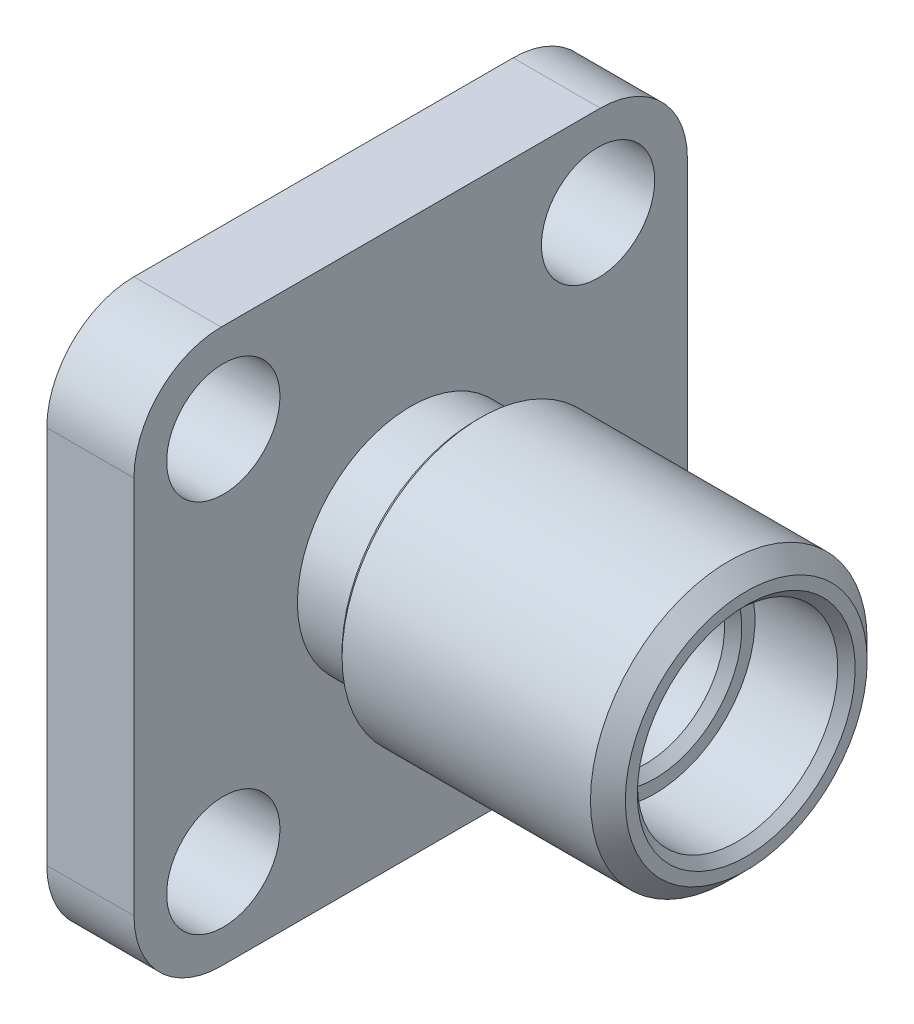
ISO-10303-21;
HEADER;
FILE_DESCRIPTION(('STEP AP214'),'2;1');
FILE_NAME('part.step','',(''),(''),'','','');
FILE_SCHEMA(('AUTOMOTIVE_DESIGN { 1 0 10303 214 1 1 1 1 }'));
ENDSEC;
DATA;
#1=APPLICATION_CONTEXT('core data for automotive mechanical design processes');
#2=APPLICATION_PROTOCOL_DEFINITION('international standard','automotive_design',2000,#1);
#3=PRODUCT_CONTEXT('',#1,'mechanical');
#4=PRODUCT('Part','Part','',(#3));
#5=PRODUCT_RELATED_PRODUCT_CATEGORY('part','',(#4));
#6=PRODUCT_DEFINITION_FORMATION('','',#4);
#7=PRODUCT_DEFINITION_CONTEXT('part definition',#1,'design');
#8=PRODUCT_DEFINITION('design','',#6,#7);
#9=PRODUCT_DEFINITION_SHAPE('','',#8);
#10=(LENGTH_UNIT() NAMED_UNIT(*) SI_UNIT(.MILLI.,.METRE.));
#11=(NAMED_UNIT(*) PLANE_ANGLE_UNIT() SI_UNIT($,.RADIAN.));
#12=(NAMED_UNIT(*) SI_UNIT($,.STERADIAN.) SOLID_ANGLE_UNIT());
#13=UNCERTAINTY_MEASURE_WITH_UNIT(LENGTH_MEASURE(1.E-05),#10,'distance_accuracy_value','');
#14=(GEOMETRIC_REPRESENTATION_CONTEXT(3) GLOBAL_UNCERTAINTY_ASSIGNED_CONTEXT((#13)) GLOBAL_UNIT_ASSIGNED_CONTEXT((#10,
#11,#12)) REPRESENTATION_CONTEXT('',''));
#15=CARTESIAN_POINT('',(0.,0.,0.));
#16=DIRECTION('',(0.,0.,1.));
#17=DIRECTION('',(1.,0.,0.));
#18=AXIS2_PLACEMENT_3D('',#15,#16,#17);
#19=CARTESIAN_POINT('',(2.,8.5,0.));
#20=DIRECTION('',(-1.,0.,0.));
#21=DIRECTION('',(0.,0.,1.));
#22=AXIS2_PLACEMENT_3D('',#19,#20,#21);
#23=PLANE('',#22);
#24=CARTESIAN_POINT('',(2.,4.3,4.3));
#25=DIRECTION('',(1.,0.,0.));
#26=DIRECTION('',(0.,0.,-1.));
#27=AXIS2_PLACEMENT_3D('',#24,#25,#26);
#28=CIRCLE('',#27,1.3);
#29=CARTESIAN_POINT('',(2.,4.3,3.));
#30=VERTEX_POINT('',#29);
#31=EDGE_CURVE('E334',#30,#30,#28,.T.);
#32=ORIENTED_EDGE('',*,*,#31,.F.);
#33=EDGE_LOOP('',(#32));
#34=FACE_BOUND('',#33,.T.);
#35=CARTESIAN_POINT('',(2.,4.3,-4.3));
#36=DIRECTION('',(1.,0.,0.));
#37=DIRECTION('',(0.,0.,-1.));
#38=AXIS2_PLACEMENT_3D('',#35,#36,#37);
#39=CIRCLE('',#38,1.3);
#40=CARTESIAN_POINT('',(2.,4.3,-5.6));
#41=VERTEX_POINT('',#40);
#42=EDGE_CURVE('E328',#41,#41,#39,.T.);
#43=ORIENTED_EDGE('',*,*,#42,.F.);
#44=EDGE_LOOP('',(#43));
#45=FACE_BOUND('',#44,.T.);
#46=CARTESIAN_POINT('',(2.,-4.3,-4.3));
#47=DIRECTION('',(1.,0.,0.));
#48=DIRECTION('',(0.,0.,-1.));
#49=AXIS2_PLACEMENT_3D('',#46,#47,#48);
#50=CIRCLE('',#49,1.3);
#51=CARTESIAN_POINT('',(2.,-4.3,-5.6));
#52=VERTEX_POINT('',#51);
#53=EDGE_CURVE('E322',#52,#52,#50,.T.);
#54=ORIENTED_EDGE('',*,*,#53,.F.);
#55=EDGE_LOOP('',(#54));
#56=FACE_BOUND('',#55,.T.);
#57=CARTESIAN_POINT('',(2.,-4.3,4.3));
#58=DIRECTION('',(1.,0.,0.));
#59=DIRECTION('',(0.,0.,-1.));
#60=AXIS2_PLACEMENT_3D('',#57,#58,#59);
#61=CIRCLE('',#60,1.3);
#62=CARTESIAN_POINT('',(2.,-4.3,3.));
#63=VERTEX_POINT('',#62);
#64=EDGE_CURVE('E316',#63,#63,#61,.T.);
#65=ORIENTED_EDGE('',*,*,#64,.F.);
#66=EDGE_LOOP('',(#65));
#67=FACE_BOUND('',#66,.T.);
#68=CARTESIAN_POINT('',(2.,0.,0.));
#69=DIRECTION('',(-1.,0.,0.));
#70=DIRECTION('',(0.,0.,1.));
#71=AXIS2_PLACEMENT_3D('',#68,#69,#70);
#72=CIRCLE('',#71,2.6);
#73=CARTESIAN_POINT('',(2.,0.,2.6));
#74=VERTEX_POINT('',#73);
#75=EDGE_CURVE('E179',#74,#74,#72,.T.);
#76=ORIENTED_EDGE('',*,*,#75,.T.);
#77=EDGE_LOOP('',(#76));
#78=FACE_BOUND('',#77,.T.);
#79=CARTESIAN_POINT('',(2.,4.35,4.35));
#80=DIRECTION('',(1.,0.,0.));
#81=DIRECTION('',(0.,0.,1.));
#82=AXIS2_PLACEMENT_3D('',#79,#80,#81);
#83=CIRCLE('',#82,2.);
#84=CARTESIAN_POINT('',(2.,6.35,4.34999999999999));
#85=VERTEX_POINT('',#84);
#86=CARTESIAN_POINT('',(2.,4.34999999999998,6.35));
#87=VERTEX_POINT('',#86);
#88=EDGE_CURVE('E138',#85,#87,#83,.T.);
#89=ORIENTED_EDGE('',*,*,#88,.T.);
#90=DIRECTION('',(0.,-1.,0.));
#91=VECTOR('',#90,1.);
#92=CARTESIAN_POINT('',(2.,-4.34999999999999,6.35));
#93=LINE('',#92,#91);
#94=CARTESIAN_POINT('',(2.,-4.34999999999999,6.35));
#95=VERTEX_POINT('',#94);
#96=EDGE_CURVE('E141',#87,#95,#93,.T.);
#97=ORIENTED_EDGE('',*,*,#96,.T.);
#98=CARTESIAN_POINT('',(2.,-4.35,4.35));
#99=DIRECTION('',(1.,0.,0.));
#100=DIRECTION('',(0.,0.,1.));
#101=AXIS2_PLACEMENT_3D('',#98,#99,#100);
#102=CIRCLE('',#101,2.);
#103=CARTESIAN_POINT('',(2.,-6.35,4.34999999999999));
#104=VERTEX_POINT('',#103);
#105=EDGE_CURVE('E51',#95,#104,#102,.T.);
#106=ORIENTED_EDGE('',*,*,#105,.T.);
#107=DIRECTION('',(0.,0.,-1.));
#108=VECTOR('',#107,1.);
#109=CARTESIAN_POINT('',(2.,-6.35,4.34999999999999));
#110=LINE('',#109,#108);
#111=CARTESIAN_POINT('',(2.,-6.35,-4.34999999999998));
#112=VERTEX_POINT('',#111);
#113=EDGE_CURVE('E108',#104,#112,#110,.T.);
#114=ORIENTED_EDGE('',*,*,#113,.T.);
#115=CARTESIAN_POINT('',(2.,-4.35,-4.35));
#116=DIRECTION('',(1.,0.,0.));
#117=DIRECTION('',(0.,0.,-1.));
#118=AXIS2_PLACEMENT_3D('',#115,#116,#117);
#119=CIRCLE('',#118,2.);
#120=CARTESIAN_POINT('',(2.,-4.34999999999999,-6.35));
#121=VERTEX_POINT('',#120);
#122=EDGE_CURVE('E147',#112,#121,#119,.T.);
#123=ORIENTED_EDGE('',*,*,#122,.T.);
#124=DIRECTION('',(0.,1.,0.));
#125=VECTOR('',#124,1.);
#126=CARTESIAN_POINT('',(2.,-4.34999999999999,-6.35));
#127=LINE('',#126,#125);
#128=CARTESIAN_POINT('',(2.,4.34999999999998,-6.35));
#129=VERTEX_POINT('',#128);
#130=EDGE_CURVE('E150',#121,#129,#127,.T.);
#131=ORIENTED_EDGE('',*,*,#130,.T.);
#132=CARTESIAN_POINT('',(2.,4.35,-4.35));
#133=DIRECTION('',(1.,0.,0.));
#134=DIRECTION('',(0.,0.,1.));
#135=AXIS2_PLACEMENT_3D('',#132,#133,#134);
#136=CIRCLE('',#135,2.);
#137=CARTESIAN_POINT('',(2.,6.35,-4.34999999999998));
#138=VERTEX_POINT('',#137);
#139=EDGE_CURVE('E153',#129,#138,#136,.T.);
#140=ORIENTED_EDGE('',*,*,#139,.T.);
#141=DIRECTION('',(0.,0.,1.));
#142=VECTOR('',#141,1.);
#143=CARTESIAN_POINT('',(2.,6.35,4.34999999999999));
#144=LINE('',#143,#142);
#145=EDGE_CURVE('E156',#138,#85,#144,.T.);
#146=ORIENTED_EDGE('',*,*,#145,.T.);
#147=EDGE_LOOP('',(#89,#97,#106,#114,#123,#131,#140,#146));
#148=FACE_BOUND('',#147,.T.);
#149=ADVANCED_FACE('F36',(#34,#45,#56,#67,#78,#148),#23,.F.);
#150=CARTESIAN_POINT('',(0.,2.,0.));
#151=DIRECTION('',(1.,0.,0.));
#152=DIRECTION('',(0.,0.,-1.));
#153=AXIS2_PLACEMENT_3D('',#150,#151,#152);
#154=PLANE('',#153);
#155=CARTESIAN_POINT('',(0.,4.3,4.3));
#156=DIRECTION('',(1.,0.,0.));
#157=DIRECTION('',(0.,0.,-1.));
#158=AXIS2_PLACEMENT_3D('',#155,#156,#157);
#159=CIRCLE('',#158,1.3);
#160=CARTESIAN_POINT('',(0.,4.3,3.));
#161=VERTEX_POINT('',#160);
#162=EDGE_CURVE('E331',#161,#161,#159,.T.);
#163=ORIENTED_EDGE('',*,*,#162,.T.);
#164=EDGE_LOOP('',(#163));
#165=FACE_BOUND('',#164,.T.);
#166=CARTESIAN_POINT('',(0.,4.3,-4.3));
#167=DIRECTION('',(1.,0.,0.));
#168=DIRECTION('',(0.,0.,-1.));
#169=AXIS2_PLACEMENT_3D('',#166,#167,#168);
#170=CIRCLE('',#169,1.3);
#171=CARTESIAN_POINT('',(0.,4.3,-5.6));
#172=VERTEX_POINT('',#171);
#173=EDGE_CURVE('E325',#172,#172,#170,.T.);
#174=ORIENTED_EDGE('',*,*,#173,.T.);
#175=EDGE_LOOP('',(#174));
#176=FACE_BOUND('',#175,.T.);
#177=CARTESIAN_POINT('',(0.,-4.3,-4.3));
#178=DIRECTION('',(1.,0.,0.));
#179=DIRECTION('',(0.,0.,-1.));
#180=AXIS2_PLACEMENT_3D('',#177,#178,#179);
#181=CIRCLE('',#180,1.3);
#182=CARTESIAN_POINT('',(0.,-4.3,-5.6));
#183=VERTEX_POINT('',#182);
#184=EDGE_CURVE('E319',#183,#183,#181,.T.);
#185=ORIENTED_EDGE('',*,*,#184,.T.);
#186=EDGE_LOOP('',(#185));
#187=FACE_BOUND('',#186,.T.);
#188=CARTESIAN_POINT('',(0.,-4.3,4.3));
#189=DIRECTION('',(1.,0.,0.));
#190=DIRECTION('',(0.,0.,-1.));
#191=AXIS2_PLACEMENT_3D('',#188,#189,#190);
#192=CIRCLE('',#191,1.3);
#193=CARTESIAN_POINT('',(0.,-4.3,3.));
#194=VERTEX_POINT('',#193);
#195=EDGE_CURVE('E142',#194,#194,#192,.T.);
#196=ORIENTED_EDGE('',*,*,#195,.T.);
#197=EDGE_LOOP('',(#196));
#198=FACE_BOUND('',#197,.T.);
#199=CARTESIAN_POINT('',(0.,0.,0.));
#200=DIRECTION('',(1.,0.,0.));
#201=DIRECTION('',(0.,0.,-1.));
#202=AXIS2_PLACEMENT_3D('',#199,#200,#201);
#203=CIRCLE('',#202,2.1);
#204=CARTESIAN_POINT('',(0.,0.,2.1));
#205=VERTEX_POINT('',#204);
#206=EDGE_CURVE('E209',#205,#205,#203,.T.);
#207=ORIENTED_EDGE('',*,*,#206,.T.);
#208=EDGE_LOOP('',(#207));
#209=FACE_BOUND('',#208,.T.);
#210=CARTESIAN_POINT('',(0.,4.35,4.35));
#211=DIRECTION('',(1.,0.,0.));
#212=DIRECTION('',(0.,0.,1.));
#213=AXIS2_PLACEMENT_3D('',#210,#211,#212);
#214=CIRCLE('',#213,2.);
#215=CARTESIAN_POINT('',(0.,6.35,4.34999999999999));
#216=VERTEX_POINT('',#215);
#217=CARTESIAN_POINT('',(0.,4.34999999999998,6.35));
#218=VERTEX_POINT('',#217);
#219=EDGE_CURVE('E59',#216,#218,#214,.T.);
#220=ORIENTED_EDGE('',*,*,#219,.F.);
#221=DIRECTION('',(0.,0.,1.));
#222=VECTOR('',#221,1.);
#223=CARTESIAN_POINT('',(0.,6.35,4.34999999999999));
#224=LINE('',#223,#222);
#225=CARTESIAN_POINT('',(0.,6.35,-4.34999999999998));
#226=VERTEX_POINT('',#225);
#227=EDGE_CURVE('E134',#226,#216,#224,.T.);
#228=ORIENTED_EDGE('',*,*,#227,.F.);
#229=CARTESIAN_POINT('',(0.,4.35,-4.35));
#230=DIRECTION('',(1.,0.,0.));
#231=DIRECTION('',(0.,0.,1.));
#232=AXIS2_PLACEMENT_3D('',#229,#230,#231);
#233=CIRCLE('',#232,2.);
#234=CARTESIAN_POINT('',(0.,4.34999999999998,-6.35));
#235=VERTEX_POINT('',#234);
#236=EDGE_CURVE('E131',#235,#226,#233,.T.);
#237=ORIENTED_EDGE('',*,*,#236,.F.);
#238=DIRECTION('',(0.,1.,0.));
#239=VECTOR('',#238,1.);
#240=CARTESIAN_POINT('',(0.,-4.34999999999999,-6.35));
#241=LINE('',#240,#239);
#242=CARTESIAN_POINT('',(0.,-4.34999999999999,-6.35));
#243=VERTEX_POINT('',#242);
#244=EDGE_CURVE('E125',#243,#235,#241,.T.);
#245=ORIENTED_EDGE('',*,*,#244,.F.);
#246=CARTESIAN_POINT('',(0.,-4.35,-4.35));
#247=DIRECTION('',(1.,0.,0.));
#248=DIRECTION('',(0.,0.,-1.));
#249=AXIS2_PLACEMENT_3D('',#246,#247,#248);
#250=CIRCLE('',#249,2.);
#251=CARTESIAN_POINT('',(0.,-6.35,-4.34999999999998));
#252=VERTEX_POINT('',#251);
#253=EDGE_CURVE('E123',#252,#243,#250,.T.);
#254=ORIENTED_EDGE('',*,*,#253,.F.);
#255=DIRECTION('',(0.,0.,-1.));
#256=VECTOR('',#255,1.);
#257=CARTESIAN_POINT('',(0.,-6.35,4.34999999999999));
#258=LINE('',#257,#256);
#259=CARTESIAN_POINT('',(0.,-6.35,4.34999999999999));
#260=VERTEX_POINT('',#259);
#261=EDGE_CURVE('E105',#260,#252,#258,.T.);
#262=ORIENTED_EDGE('',*,*,#261,.F.);
#263=CARTESIAN_POINT('',(0.,-4.35,4.35));
#264=DIRECTION('',(1.,0.,0.));
#265=DIRECTION('',(0.,0.,1.));
#266=AXIS2_PLACEMENT_3D('',#263,#264,#265);
#267=CIRCLE('',#266,2.);
#268=CARTESIAN_POINT('',(0.,-4.34999999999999,6.35));
#269=VERTEX_POINT('',#268);
#270=EDGE_CURVE('E113',#269,#260,#267,.T.);
#271=ORIENTED_EDGE('',*,*,#270,.F.);
#272=DIRECTION('',(0.,-1.,0.));
#273=VECTOR('',#272,1.);
#274=CARTESIAN_POINT('',(0.,-4.34999999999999,6.35));
#275=LINE('',#274,#273);
#276=EDGE_CURVE('E118',#218,#269,#275,.T.);
#277=ORIENTED_EDGE('',*,*,#276,.F.);
#278=EDGE_LOOP('',(#220,#228,#237,#245,#254,#262,#271,#277));
#279=FACE_BOUND('',#278,.T.);
#280=ADVANCED_FACE('F120',(#165,#176,#187,#198,#209,#279),#154,.F.);
#281=CARTESIAN_POINT('',(0.,0.,0.));
#282=DIRECTION('',(-1.,0.,0.));
#283=DIRECTION('',(0.,0.,1.));
#284=AXIS2_PLACEMENT_3D('',#281,#282,#283);
#285=CYLINDRICAL_SURFACE('',#284,2.6);
#286=ORIENTED_EDGE('',*,*,#75,.F.);
#287=EDGE_LOOP('',(#286));
#288=FACE_BOUND('',#287,.T.);
#289=CARTESIAN_POINT('',(3.5,0.,0.));
#290=DIRECTION('',(-1.,0.,0.));
#291=DIRECTION('',(0.,0.,1.));
#292=AXIS2_PLACEMENT_3D('',#289,#290,#291);
#293=CIRCLE('',#292,2.6);
#294=CARTESIAN_POINT('',(3.5,0.,2.6));
#295=VERTEX_POINT('',#294);
#296=EDGE_CURVE('E176',#295,#295,#293,.T.);
#297=ORIENTED_EDGE('',*,*,#296,.T.);
#298=EDGE_LOOP('',(#297));
#299=FACE_BOUND('',#298,.T.);
#300=ADVANCED_FACE('F237',(#288,#299),#285,.T.);
#301=CARTESIAN_POINT('',(3.5,2.6,0.));
#302=DIRECTION('',(1.,0.,0.));
#303=DIRECTION('',(0.,0.,-1.));
#304=AXIS2_PLACEMENT_3D('',#301,#302,#303);
#305=PLANE('',#304);
#306=CARTESIAN_POINT('',(3.5,0.,0.));
#307=DIRECTION('',(1.,0.,0.));
#308=DIRECTION('',(0.,0.,-1.));
#309=AXIS2_PLACEMENT_3D('',#306,#307,#308);
#310=CIRCLE('',#309,3.075);
#311=CARTESIAN_POINT('',(3.5,0.,-3.075));
#312=VERTEX_POINT('',#311);
#313=EDGE_CURVE('E44',#312,#312,#310,.F.);
#314=ORIENTED_EDGE('',*,*,#313,.T.);
#315=EDGE_LOOP('',(#314));
#316=FACE_BOUND('',#315,.T.);
#317=ORIENTED_EDGE('',*,*,#296,.F.);
#318=EDGE_LOOP('',(#317));
#319=FACE_BOUND('',#318,.T.);
#320=ADVANCED_FACE('F214',(#316,#319),#305,.F.);
#321=CARTESIAN_POINT('',(0.,0.,0.));
#322=DIRECTION('',(-1.,0.,0.));
#323=DIRECTION('',(0.,0.,1.));
#324=AXIS2_PLACEMENT_3D('',#321,#322,#323);
#325=CYLINDRICAL_SURFACE('',#324,3.175);
#326=CARTESIAN_POINT('',(3.6,0.,0.));
#327=DIRECTION('',(1.,0.,0.));
#328=DIRECTION('',(0.,0.,-1.));
#329=AXIS2_PLACEMENT_3D('',#326,#327,#328);
#330=CIRCLE('',#329,3.175);
#331=CARTESIAN_POINT('',(3.6,0.,-3.175));
#332=VERTEX_POINT('',#331);
#333=EDGE_CURVE('E11',#332,#332,#330,.T.);
#334=ORIENTED_EDGE('',*,*,#333,.T.);
#335=EDGE_LOOP('',(#334));
#336=FACE_BOUND('',#335,.T.);
#337=CARTESIAN_POINT('',(9.3,0.,0.));
#338=DIRECTION('',(-1.,0.,0.));
#339=DIRECTION('',(0.,0.,1.));
#340=AXIS2_PLACEMENT_3D('',#337,#338,#339);
#341=CIRCLE('',#340,3.175);
#342=CARTESIAN_POINT('',(9.3,0.,3.175));
#343=VERTEX_POINT('',#342);
#344=EDGE_CURVE('E182',#343,#343,#341,.T.);
#345=ORIENTED_EDGE('',*,*,#344,.T.);
#346=EDGE_LOOP('',(#345));
#347=FACE_BOUND('',#346,.T.);
#348=ADVANCED_FACE('F289',(#336,#347),#325,.T.);
#349=CARTESIAN_POINT('',(9.7,3.175,0.));
#350=DIRECTION('',(-1.,0.,0.));
#351=DIRECTION('',(0.,0.,1.));
#352=AXIS2_PLACEMENT_3D('',#349,#350,#351);
#353=PLANE('',#352);
#354=CARTESIAN_POINT('',(9.7,0.,0.));
#355=DIRECTION('',(-1.,0.,0.));
#356=DIRECTION('',(0.,0.,1.));
#357=AXIS2_PLACEMENT_3D('',#354,#355,#356);
#358=CIRCLE('',#357,2.5);
#359=CARTESIAN_POINT('',(9.7,0.,2.5));
#360=VERTEX_POINT('',#359);
#361=EDGE_CURVE('E188',#360,#360,#358,.T.);
#362=ORIENTED_EDGE('',*,*,#361,.T.);
#363=EDGE_LOOP('',(#362));
#364=FACE_BOUND('',#363,.T.);
#365=CARTESIAN_POINT('',(9.7,0.,0.));
#366=DIRECTION('',(-1.,0.,0.));
#367=DIRECTION('',(0.,0.,1.));
#368=AXIS2_PLACEMENT_3D('',#365,#366,#367);
#369=CIRCLE('',#368,2.775);
#370=CARTESIAN_POINT('',(9.7,0.,2.775));
#371=VERTEX_POINT('',#370);
#372=EDGE_CURVE('E185',#371,#371,#369,.F.);
#373=ORIENTED_EDGE('',*,*,#372,.T.);
#374=EDGE_LOOP('',(#373));
#375=FACE_BOUND('',#374,.T.);
#376=ADVANCED_FACE('F283',(#364,#375),#353,.F.);
#377=CARTESIAN_POINT('',(0.,0.,0.));
#378=DIRECTION('',(-1.,0.,0.));
#379=DIRECTION('',(0.,0.,1.));
#380=AXIS2_PLACEMENT_3D('',#377,#378,#379);
#381=CYLINDRICAL_SURFACE('',#380,2.3);
#382=CARTESIAN_POINT('',(9.5,0.,0.));
#383=DIRECTION('',(-1.,0.,0.));
#384=DIRECTION('',(0.,0.,1.));
#385=AXIS2_PLACEMENT_3D('',#382,#383,#384);
#386=CIRCLE('',#385,2.3);
#387=CARTESIAN_POINT('',(9.5,0.,2.3));
#388=VERTEX_POINT('',#387);
#389=EDGE_CURVE('E191',#388,#388,#386,.F.);
#390=ORIENTED_EDGE('',*,*,#389,.T.);
#391=EDGE_LOOP('',(#390));
#392=FACE_BOUND('',#391,.T.);
#393=CARTESIAN_POINT('',(7.6,0.,0.));
#394=DIRECTION('',(-1.,0.,0.));
#395=DIRECTION('',(0.,0.,1.));
#396=AXIS2_PLACEMENT_3D('',#393,#394,#395);
#397=CIRCLE('',#396,2.3);
#398=CARTESIAN_POINT('',(7.6,0.,2.3));
#399=VERTEX_POINT('',#398);
#400=EDGE_CURVE('E173',#399,#399,#397,.T.);
#401=ORIENTED_EDGE('',*,*,#400,.T.);
#402=EDGE_LOOP('',(#401));
#403=FACE_BOUND('',#402,.T.);
#404=ADVANCED_FACE('F278',(#392,#403),#381,.F.);
#405=CARTESIAN_POINT('',(7.6,2.3,0.));
#406=DIRECTION('',(-1.,0.,0.));
#407=DIRECTION('',(0.,0.,1.));
#408=AXIS2_PLACEMENT_3D('',#405,#406,#407);
#409=PLANE('',#408);
#410=CARTESIAN_POINT('',(7.6,0.,0.));
#411=DIRECTION('',(-1.,0.,0.));
#412=DIRECTION('',(0.,0.,1.));
#413=AXIS2_PLACEMENT_3D('',#410,#411,#412);
#414=CIRCLE('',#413,2.);
#415=CARTESIAN_POINT('',(7.6,0.,2.));
#416=VERTEX_POINT('',#415);
#417=EDGE_CURVE('E194',#416,#416,#414,.T.);
#418=ORIENTED_EDGE('',*,*,#417,.T.);
#419=EDGE_LOOP('',(#418));
#420=FACE_BOUND('',#419,.T.);
#421=ORIENTED_EDGE('',*,*,#400,.F.);
#422=EDGE_LOOP('',(#421));
#423=FACE_BOUND('',#422,.T.);
#424=ADVANCED_FACE('F270',(#420,#423),#409,.F.);
#425=CARTESIAN_POINT('',(0.,0.,0.));
#426=DIRECTION('',(-1.,0.,0.));
#427=DIRECTION('',(0.,0.,1.));
#428=AXIS2_PLACEMENT_3D('',#425,#426,#427);
#429=CYLINDRICAL_SURFACE('',#428,1.8);
#430=CARTESIAN_POINT('',(6.6,0.,0.));
#431=DIRECTION('',(1.,0.,0.));
#432=DIRECTION('',(0.,0.,-1.));
#433=AXIS2_PLACEMENT_3D('',#430,#431,#432);
#434=CIRCLE('',#433,1.8);
#435=CARTESIAN_POINT('',(6.6,0.,-1.8));
#436=VERTEX_POINT('',#435);
#437=EDGE_CURVE('E200',#436,#436,#434,.F.);
#438=ORIENTED_EDGE('',*,*,#437,.T.);
#439=EDGE_LOOP('',(#438));
#440=FACE_BOUND('',#439,.T.);
#441=CARTESIAN_POINT('',(7.4,0.,0.));
#442=DIRECTION('',(-1.,0.,0.));
#443=DIRECTION('',(0.,0.,1.));
#444=AXIS2_PLACEMENT_3D('',#441,#442,#443);
#445=CIRCLE('',#444,1.8);
#446=CARTESIAN_POINT('',(7.4,0.,1.8));
#447=VERTEX_POINT('',#446);
#448=EDGE_CURVE('E197',#447,#447,#445,.F.);
#449=ORIENTED_EDGE('',*,*,#448,.T.);
#450=EDGE_LOOP('',(#449));
#451=FACE_BOUND('',#450,.T.);
#452=ADVANCED_FACE('F266',(#440,#451),#429,.F.);
#453=CARTESIAN_POINT('',(6.5,2.,0.));
#454=DIRECTION('',(1.,0.,0.));
#455=DIRECTION('',(0.,0.,-1.));
#456=AXIS2_PLACEMENT_3D('',#453,#454,#455);
#457=PLANE('',#456);
#458=CARTESIAN_POINT('',(6.5,0.,0.));
#459=DIRECTION('',(1.,0.,0.));
#460=DIRECTION('',(0.,0.,-1.));
#461=AXIS2_PLACEMENT_3D('',#458,#459,#460);
#462=CIRCLE('',#461,1.9);
#463=CARTESIAN_POINT('',(6.5,0.,-1.9));
#464=VERTEX_POINT('',#463);
#465=EDGE_CURVE('E203',#464,#464,#462,.T.);
#466=ORIENTED_EDGE('',*,*,#465,.T.);
#467=EDGE_LOOP('',(#466));
#468=FACE_BOUND('',#467,.T.);
#469=CARTESIAN_POINT('',(6.5,0.,0.));
#470=DIRECTION('',(-1.,0.,0.));
#471=DIRECTION('',(0.,0.,1.));
#472=AXIS2_PLACEMENT_3D('',#469,#470,#471);
#473=CIRCLE('',#472,2.);
#474=CARTESIAN_POINT('',(6.5,0.,2.));
#475=VERTEX_POINT('',#474);
#476=EDGE_CURVE('E161',#475,#475,#473,.T.);
#477=ORIENTED_EDGE('',*,*,#476,.T.);
#478=EDGE_LOOP('',(#477));
#479=FACE_BOUND('',#478,.T.);
#480=ADVANCED_FACE('F269',(#468,#479),#457,.F.);
#481=CARTESIAN_POINT('',(0.,0.,0.));
#482=DIRECTION('',(-1.,0.,0.));
#483=DIRECTION('',(0.,0.,1.));
#484=AXIS2_PLACEMENT_3D('',#481,#482,#483);
#485=CYLINDRICAL_SURFACE('',#484,2.);
#486=CARTESIAN_POINT('',(0.0999999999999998,0.,0.));
#487=DIRECTION('',(1.,0.,0.));
#488=DIRECTION('',(0.,0.,-1.));
#489=AXIS2_PLACEMENT_3D('',#486,#487,#488);
#490=CIRCLE('',#489,2.);
#491=CARTESIAN_POINT('',(0.0999999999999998,0.,2.));
#492=VERTEX_POINT('',#491);
#493=EDGE_CURVE('E206',#492,#492,#490,.F.);
#494=ORIENTED_EDGE('',*,*,#493,.T.);
#495=EDGE_LOOP('',(#494));
#496=FACE_BOUND('',#495,.T.);
#497=ORIENTED_EDGE('',*,*,#476,.F.);
#498=EDGE_LOOP('',(#497));
#499=FACE_BOUND('',#498,.T.);
#500=ADVANCED_FACE('F375',(#496,#499),#485,.F.);
#501=CARTESIAN_POINT('',(0.,4.35,4.35));
#502=DIRECTION('',(1.,0.,0.));
#503=DIRECTION('',(0.,0.,-1.));
#504=AXIS2_PLACEMENT_3D('',#501,#502,#503);
#505=CYLINDRICAL_SURFACE('',#504,2.);
#506=ORIENTED_EDGE('',*,*,#88,.F.);
#507=DIRECTION('',(1.,0.,0.));
#508=VECTOR('',#507,1.);
#509=CARTESIAN_POINT('',(0.,6.35,4.34999999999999));
#510=LINE('',#509,#508);
#511=EDGE_CURVE('E159',#216,#85,#510,.T.);
#512=ORIENTED_EDGE('',*,*,#511,.F.);
#513=ORIENTED_EDGE('',*,*,#219,.T.);
#514=DIRECTION('',(1.,0.,0.));
#515=VECTOR('',#514,1.);
#516=CARTESIAN_POINT('',(0.,4.34999999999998,6.35));
#517=LINE('',#516,#515);
#518=EDGE_CURVE('E137',#218,#87,#517,.T.);
#519=ORIENTED_EDGE('',*,*,#518,.T.);
#520=EDGE_LOOP('',(#506,#512,#513,#519));
#521=FACE_BOUND('',#520,.T.);
#522=ADVANCED_FACE('F310',(#521),#505,.T.);
#523=CARTESIAN_POINT('',(0.,6.35,4.34999999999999));
#524=DIRECTION('',(0.,1.,0.));
#525=DIRECTION('',(0.,0.,1.));
#526=AXIS2_PLACEMENT_3D('',#523,#524,#525);
#527=PLANE('',#526);
#528=ORIENTED_EDGE('',*,*,#145,.F.);
#529=DIRECTION('',(1.,0.,0.));
#530=VECTOR('',#529,1.);
#531=CARTESIAN_POINT('',(0.,6.35,-4.34999999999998));
#532=LINE('',#531,#530);
#533=EDGE_CURVE('E162',#226,#138,#532,.T.);
#534=ORIENTED_EDGE('',*,*,#533,.F.);
#535=ORIENTED_EDGE('',*,*,#227,.T.);
#536=ORIENTED_EDGE('',*,*,#511,.T.);
#537=EDGE_LOOP('',(#528,#534,#535,#536));
#538=FACE_BOUND('',#537,.T.);
#539=ADVANCED_FACE('F352',(#538),#527,.T.);
#540=CARTESIAN_POINT('',(0.,4.35,-4.35));
#541=DIRECTION('',(1.,0.,0.));
#542=DIRECTION('',(0.,0.,-1.));
#543=AXIS2_PLACEMENT_3D('',#540,#541,#542);
#544=CYLINDRICAL_SURFACE('',#543,2.);
#545=ORIENTED_EDGE('',*,*,#139,.F.);
#546=DIRECTION('',(1.,0.,0.));
#547=VECTOR('',#546,1.);
#548=CARTESIAN_POINT('',(0.,4.34999999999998,-6.35));
#549=LINE('',#548,#547);
#550=EDGE_CURVE('E164',#235,#129,#549,.T.);
#551=ORIENTED_EDGE('',*,*,#550,.F.);
#552=ORIENTED_EDGE('',*,*,#236,.T.);
#553=ORIENTED_EDGE('',*,*,#533,.T.);
#554=EDGE_LOOP('',(#545,#551,#552,#553));
#555=FACE_BOUND('',#554,.T.);
#556=ADVANCED_FACE('F355',(#555),#544,.T.);
#557=CARTESIAN_POINT('',(0.,-4.34999999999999,-6.35));
#558=DIRECTION('',(0.,0.,-1.));
#559=DIRECTION('',(-1.,0.,0.));
#560=AXIS2_PLACEMENT_3D('',#557,#558,#559);
#561=PLANE('',#560);
#562=ORIENTED_EDGE('',*,*,#130,.F.);
#563=DIRECTION('',(1.,0.,0.));
#564=VECTOR('',#563,1.);
#565=CARTESIAN_POINT('',(0.,-4.34999999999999,-6.35));
#566=LINE('',#565,#564);
#567=EDGE_CURVE('E166',#243,#121,#566,.T.);
#568=ORIENTED_EDGE('',*,*,#567,.F.);
#569=ORIENTED_EDGE('',*,*,#244,.T.);
#570=ORIENTED_EDGE('',*,*,#550,.T.);
#571=EDGE_LOOP('',(#562,#568,#569,#570));
#572=FACE_BOUND('',#571,.T.);
#573=ADVANCED_FACE('F359',(#572),#561,.T.);
#574=CARTESIAN_POINT('',(0.,-4.35,-4.35));
#575=DIRECTION('',(1.,0.,0.));
#576=DIRECTION('',(0.,0.,-1.));
#577=AXIS2_PLACEMENT_3D('',#574,#575,#576);
#578=CYLINDRICAL_SURFACE('',#577,2.);
#579=ORIENTED_EDGE('',*,*,#122,.F.);
#580=DIRECTION('',(1.,0.,0.));
#581=VECTOR('',#580,1.);
#582=CARTESIAN_POINT('',(0.,-6.35,-4.34999999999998));
#583=LINE('',#582,#581);
#584=EDGE_CURVE('E109',#252,#112,#583,.T.);
#585=ORIENTED_EDGE('',*,*,#584,.F.);
#586=ORIENTED_EDGE('',*,*,#253,.T.);
#587=ORIENTED_EDGE('',*,*,#567,.T.);
#588=EDGE_LOOP('',(#579,#585,#586,#587));
#589=FACE_BOUND('',#588,.T.);
#590=ADVANCED_FACE('F363',(#589),#578,.T.);
#591=CARTESIAN_POINT('',(0.,-6.35,4.34999999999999));
#592=DIRECTION('',(0.,-1.,0.));
#593=DIRECTION('',(0.,0.,-1.));
#594=AXIS2_PLACEMENT_3D('',#591,#592,#593);
#595=PLANE('',#594);
#596=ORIENTED_EDGE('',*,*,#113,.F.);
#597=DIRECTION('',(1.,0.,0.));
#598=VECTOR('',#597,1.);
#599=CARTESIAN_POINT('',(0.,-6.35,4.34999999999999));
#600=LINE('',#599,#598);
#601=EDGE_CURVE('E101',#260,#104,#600,.T.);
#602=ORIENTED_EDGE('',*,*,#601,.F.);
#603=ORIENTED_EDGE('',*,*,#261,.T.);
#604=ORIENTED_EDGE('',*,*,#584,.T.);
#605=EDGE_LOOP('',(#596,#602,#603,#604));
#606=FACE_BOUND('',#605,.T.);
#607=ADVANCED_FACE('F103',(#606),#595,.T.);
#608=CARTESIAN_POINT('',(0.,-4.35,4.35));
#609=DIRECTION('',(1.,0.,0.));
#610=DIRECTION('',(0.,0.,-1.));
#611=AXIS2_PLACEMENT_3D('',#608,#609,#610);
#612=CYLINDRICAL_SURFACE('',#611,2.);
#613=ORIENTED_EDGE('',*,*,#105,.F.);
#614=DIRECTION('',(1.,0.,0.));
#615=VECTOR('',#614,1.);
#616=CARTESIAN_POINT('',(0.,-4.34999999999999,6.35));
#617=LINE('',#616,#615);
#618=EDGE_CURVE('E110',#269,#95,#617,.T.);
#619=ORIENTED_EDGE('',*,*,#618,.F.);
#620=ORIENTED_EDGE('',*,*,#270,.T.);
#621=ORIENTED_EDGE('',*,*,#601,.T.);
#622=EDGE_LOOP('',(#613,#619,#620,#621));
#623=FACE_BOUND('',#622,.T.);
#624=ADVANCED_FACE('F114',(#623),#612,.T.);
#625=CARTESIAN_POINT('',(0.,-4.34999999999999,6.35));
#626=DIRECTION('',(0.,0.,1.));
#627=DIRECTION('',(1.,0.,0.));
#628=AXIS2_PLACEMENT_3D('',#625,#626,#627);
#629=PLANE('',#628);
#630=ORIENTED_EDGE('',*,*,#96,.F.);
#631=ORIENTED_EDGE('',*,*,#518,.F.);
#632=ORIENTED_EDGE('',*,*,#276,.T.);
#633=ORIENTED_EDGE('',*,*,#618,.T.);
#634=EDGE_LOOP('',(#630,#631,#632,#633));
#635=FACE_BOUND('',#634,.T.);
#636=ADVANCED_FACE('F249',(#635),#629,.T.);
#637=CARTESIAN_POINT('',(9.3,0.,0.));
#638=DIRECTION('',(-1.,0.,0.));
#639=DIRECTION('',(0.,0.,1.));
#640=AXIS2_PLACEMENT_3D('',#637,#638,#639);
#641=CONICAL_SURFACE('',#640,3.175,0.785398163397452);
#642=CARTESIAN_POINT('',(9.7,0.,2.775));
#643=CARTESIAN_POINT('',(9.69583333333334,0.,2.77916666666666));
#644=CARTESIAN_POINT('',(9.69166666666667,0.,2.78333333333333));
#645=CARTESIAN_POINT('',(9.68333333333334,0.,2.79166666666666));
#646=CARTESIAN_POINT('',(9.67916666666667,0.,2.79583333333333));
#647=CARTESIAN_POINT('',(9.67083333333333,0.,2.80416666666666));
#648=CARTESIAN_POINT('',(9.66666666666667,0.,2.80833333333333));
#649=CARTESIAN_POINT('',(9.65833333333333,0.,2.81666666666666));
#650=CARTESIAN_POINT('',(9.65416666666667,0.,2.82083333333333));
#651=CARTESIAN_POINT('',(9.64583333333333,0.,2.82916666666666));
#652=CARTESIAN_POINT('',(9.64166666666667,0.,2.83333333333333));
#653=CARTESIAN_POINT('',(9.63333333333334,0.,2.84166666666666));
#654=CARTESIAN_POINT('',(9.62916666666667,0.,2.84583333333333));
#655=CARTESIAN_POINT('',(9.62083333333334,0.,2.85416666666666));
#656=CARTESIAN_POINT('',(9.61666666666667,0.,2.85833333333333));
#657=CARTESIAN_POINT('',(9.60833333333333,0.,2.86666666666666));
#658=CARTESIAN_POINT('',(9.60416666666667,0.,2.87083333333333));
#659=CARTESIAN_POINT('',(9.59583333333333,0.,2.87916666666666));
#660=CARTESIAN_POINT('',(9.59166666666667,0.,2.88333333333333));
#661=CARTESIAN_POINT('',(9.58333333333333,0.,2.89166666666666));
#662=CARTESIAN_POINT('',(9.57916666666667,0.,2.89583333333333));
#663=CARTESIAN_POINT('',(9.57083333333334,0.,2.90416666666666));
#664=CARTESIAN_POINT('',(9.56666666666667,0.,2.90833333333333));
#665=CARTESIAN_POINT('',(9.55833333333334,0.,2.91666666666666));
#666=CARTESIAN_POINT('',(9.55416666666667,0.,2.92083333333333));
#667=CARTESIAN_POINT('',(9.54583333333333,0.,2.92916666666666));
#668=CARTESIAN_POINT('',(9.54166666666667,0.,2.93333333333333));
#669=CARTESIAN_POINT('',(9.53333333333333,0.,2.94166666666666));
#670=CARTESIAN_POINT('',(9.52916666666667,0.,2.94583333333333));
#671=CARTESIAN_POINT('',(9.52083333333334,0.,2.95416666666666));
#672=CARTESIAN_POINT('',(9.51666666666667,0.,2.95833333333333));
#673=CARTESIAN_POINT('',(9.50833333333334,0.,2.96666666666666));
#674=CARTESIAN_POINT('',(9.50416666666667,0.,2.97083333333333));
#675=CARTESIAN_POINT('',(9.49583333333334,0.,2.97916666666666));
#676=CARTESIAN_POINT('',(9.49166666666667,0.,2.98333333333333));
#677=CARTESIAN_POINT('',(9.48333333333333,0.,2.99166666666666));
#678=CARTESIAN_POINT('',(9.47916666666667,0.,2.99583333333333));
#679=CARTESIAN_POINT('',(9.47083333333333,0.,3.00416666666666));
#680=CARTESIAN_POINT('',(9.46666666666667,0.,3.00833333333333));
#681=CARTESIAN_POINT('',(9.45833333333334,0.,3.01666666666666));
#682=CARTESIAN_POINT('',(9.45416666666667,0.,3.02083333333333));
#683=CARTESIAN_POINT('',(9.44583333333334,0.,3.02916666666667));
#684=CARTESIAN_POINT('',(9.44166666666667,0.,3.03333333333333));
#685=CARTESIAN_POINT('',(9.43333333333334,0.,3.04166666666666));
#686=CARTESIAN_POINT('',(9.42916666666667,0.,3.04583333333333));
#687=CARTESIAN_POINT('',(9.42083333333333,0.,3.05416666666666));
#688=CARTESIAN_POINT('',(9.41666666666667,0.,3.05833333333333));
#689=CARTESIAN_POINT('',(9.40833333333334,0.,3.06666666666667));
#690=CARTESIAN_POINT('',(9.40416666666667,0.,3.07083333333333));
#691=CARTESIAN_POINT('',(9.39583333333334,0.,3.07916666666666));
#692=CARTESIAN_POINT('',(9.39166666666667,0.,3.08333333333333));
#693=CARTESIAN_POINT('',(9.38333333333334,0.,3.09166666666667));
#694=CARTESIAN_POINT('',(9.37916666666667,0.,3.09583333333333));
#695=CARTESIAN_POINT('',(9.37083333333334,0.,3.10416666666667));
#696=CARTESIAN_POINT('',(9.36666666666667,0.,3.10833333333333));
#697=CARTESIAN_POINT('',(9.35833333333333,0.,3.11666666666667));
#698=CARTESIAN_POINT('',(9.35416666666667,0.,3.12083333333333));
#699=CARTESIAN_POINT('',(9.34583333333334,0.,3.12916666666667));
#700=CARTESIAN_POINT('',(9.34166666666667,0.,3.13333333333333));
#701=CARTESIAN_POINT('',(9.33333333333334,0.,3.14166666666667));
#702=CARTESIAN_POINT('',(9.32916666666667,0.,3.14583333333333));
#703=CARTESIAN_POINT('',(9.32083333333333,0.,3.15416666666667));
#704=CARTESIAN_POINT('',(9.31666666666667,0.,3.15833333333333));
#705=CARTESIAN_POINT('',(9.30833333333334,0.,3.16666666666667));
#706=CARTESIAN_POINT('',(9.30416666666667,0.,3.17083333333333));
#707=CARTESIAN_POINT('',(9.3,0.,3.175));
#708=B_SPLINE_CURVE_WITH_KNOTS('',3,(#642,#643,#644,#645,#646,#647,#648,#649,#650,#651,#652,
#653,#654,#655,#656,#657,#658,#659,#660,#661,#662,#663,#664,#665,#666,#667,#668,#669,#670,#671,
#672,#673,#674,#675,#676,#677,#678,#679,#680,#681,#682,#683,#684,#685,#686,#687,#688,#689,#690,
#691,#692,#693,#694,#695,#696,#697,#698,#699,#700,#701,#702,#703,#704,#705,#706,#707),
.UNSPECIFIED.,.F.,.F.,(4,2,2,2,2,2,2,2,2,2,2,2,2,2,2,2,2,2,2,2,2,2,2,2,2,2,2,2,2,2,2,2,4),(0.,
0.0176776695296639,0.0353553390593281,0.053033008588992,0.0707106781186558,0.0883883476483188,
0.106066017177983,0.123743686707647,0.141421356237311,0.159099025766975,0.176776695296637,
0.194454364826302,0.212132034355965,0.229809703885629,0.247487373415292,0.265165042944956,
0.28284271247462,0.300520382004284,0.318198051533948,0.335875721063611,0.353553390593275,
0.371231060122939,0.388908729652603,0.406586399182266,0.42426406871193,0.441941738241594,
0.459619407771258,0.477297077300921,0.494974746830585,0.512652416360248,0.530330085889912,
0.548007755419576,0.56568542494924),.UNSPECIFIED.);
#709=EDGE_CURVE('BSEAM245',#371,#343,#708,.T.);
#710=ORIENTED_EDGE('',*,*,#372,.F.);
#711=ORIENTED_EDGE('',*,*,#344,.F.);
#712=ORIENTED_EDGE('',*,*,#709,.T.);
#713=ORIENTED_EDGE('',*,*,#709,.F.);
#714=EDGE_LOOP('',(#710,#712,#711,#713));
#715=FACE_BOUND('',#714,.T.);
#716=ADVANCED_FACE('F245',(#715),#641,.T.);
#717=CARTESIAN_POINT('',(9.7,0.,0.));
#718=DIRECTION('',(1.,0.,0.));
#719=DIRECTION('',(0.,0.,-1.));
#720=AXIS2_PLACEMENT_3D('',#717,#718,#719);
#721=CONICAL_SURFACE('',#720,2.5,0.78539816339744);
#722=ORIENTED_EDGE('',*,*,#389,.F.);
#723=EDGE_LOOP('',(#722));
#724=FACE_BOUND('',#723,.T.);
#725=ORIENTED_EDGE('',*,*,#361,.F.);
#726=EDGE_LOOP('',(#725));
#727=FACE_BOUND('',#726,.T.);
#728=ADVANCED_FACE('F248',(#724,#727),#721,.F.);
#729=CARTESIAN_POINT('',(7.6,0.,0.));
#730=DIRECTION('',(1.,0.,0.));
#731=DIRECTION('',(0.,0.,-1.));
#732=AXIS2_PLACEMENT_3D('',#729,#730,#731);
#733=CONICAL_SURFACE('',#732,2.,0.785398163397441);
#734=ORIENTED_EDGE('',*,*,#448,.F.);
#735=EDGE_LOOP('',(#734));
#736=FACE_BOUND('',#735,.T.);
#737=ORIENTED_EDGE('',*,*,#417,.F.);
#738=EDGE_LOOP('',(#737));
#739=FACE_BOUND('',#738,.T.);
#740=ADVANCED_FACE('F253',(#736,#739),#733,.F.);
#741=CARTESIAN_POINT('',(6.6,0.,0.));
#742=DIRECTION('',(-1.,0.,0.));
#743=DIRECTION('',(0.,0.,1.));
#744=AXIS2_PLACEMENT_3D('',#741,#742,#743);
#745=CONICAL_SURFACE('',#744,1.8,0.785398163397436);
#746=ORIENTED_EDGE('',*,*,#465,.F.);
#747=EDGE_LOOP('',(#746));
#748=FACE_BOUND('',#747,.T.);
#749=ORIENTED_EDGE('',*,*,#437,.F.);
#750=EDGE_LOOP('',(#749));
#751=FACE_BOUND('',#750,.T.);
#752=ADVANCED_FACE('F228',(#748,#751),#745,.F.);
#753=CARTESIAN_POINT('',(0.0999999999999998,0.,0.));
#754=DIRECTION('',(-1.,0.,0.));
#755=DIRECTION('',(0.,0.,1.));
#756=AXIS2_PLACEMENT_3D('',#753,#754,#755);
#757=CONICAL_SURFACE('',#756,2.,0.785398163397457);
#758=CARTESIAN_POINT('',(0.,0.,2.1));
#759=CARTESIAN_POINT('',(0.00104166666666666,0.,2.09895833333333));
#760=CARTESIAN_POINT('',(0.00208333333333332,0.,2.09791666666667));
#761=CARTESIAN_POINT('',(0.00416666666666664,0.,2.09583333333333));
#762=CARTESIAN_POINT('',(0.00520833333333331,0.,2.09479166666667));
#763=CARTESIAN_POINT('',(0.00729166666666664,0.,2.09270833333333));
#764=CARTESIAN_POINT('',(0.00833333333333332,0.,2.09166666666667));
#765=CARTESIAN_POINT('',(0.0104166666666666,0.,2.08958333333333));
#766=CARTESIAN_POINT('',(0.0114583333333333,0.,2.08854166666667));
#767=CARTESIAN_POINT('',(0.0135416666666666,0.,2.08645833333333));
#768=CARTESIAN_POINT('',(0.0145833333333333,0.,2.08541666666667));
#769=CARTESIAN_POINT('',(0.0166666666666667,0.,2.08333333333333));
#770=CARTESIAN_POINT('',(0.0177083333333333,0.,2.08229166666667));
#771=CARTESIAN_POINT('',(0.0197916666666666,0.,2.08020833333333));
#772=CARTESIAN_POINT('',(0.0208333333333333,0.,2.07916666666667));
#773=CARTESIAN_POINT('',(0.0229166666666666,0.,2.07708333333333));
#774=CARTESIAN_POINT('',(0.0239583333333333,0.,2.07604166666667));
#775=CARTESIAN_POINT('',(0.0260416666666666,0.,2.07395833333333));
#776=CARTESIAN_POINT('',(0.0270833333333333,0.,2.07291666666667));
#777=CARTESIAN_POINT('',(0.0291666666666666,0.,2.07083333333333));
#778=CARTESIAN_POINT('',(0.0302083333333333,0.,2.06979166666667));
#779=CARTESIAN_POINT('',(0.0322916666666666,0.,2.06770833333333));
#780=CARTESIAN_POINT('',(0.0333333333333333,0.,2.06666666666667));
#781=CARTESIAN_POINT('',(0.0354166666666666,0.,2.06458333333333));
#782=CARTESIAN_POINT('',(0.0364583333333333,0.,2.06354166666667));
#783=CARTESIAN_POINT('',(0.0385416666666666,0.,2.06145833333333));
#784=CARTESIAN_POINT('',(0.0395833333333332,0.,2.06041666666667));
#785=CARTESIAN_POINT('',(0.0416666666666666,0.,2.05833333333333));
#786=CARTESIAN_POINT('',(0.0427083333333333,0.,2.05729166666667));
#787=CARTESIAN_POINT('',(0.0447916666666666,0.,2.05520833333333));
#788=CARTESIAN_POINT('',(0.0458333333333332,0.,2.05416666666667));
#789=CARTESIAN_POINT('',(0.0479166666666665,0.,2.05208333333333));
#790=CARTESIAN_POINT('',(0.0489583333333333,0.,2.05104166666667));
#791=CARTESIAN_POINT('',(0.0510416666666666,0.,2.04895833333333));
#792=CARTESIAN_POINT('',(0.0520833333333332,0.,2.04791666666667));
#793=CARTESIAN_POINT('',(0.0541666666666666,0.,2.04583333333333));
#794=CARTESIAN_POINT('',(0.0552083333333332,0.,2.04479166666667));
#795=CARTESIAN_POINT('',(0.0572916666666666,0.,2.04270833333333));
#796=CARTESIAN_POINT('',(0.0583333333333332,0.,2.04166666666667));
#797=CARTESIAN_POINT('',(0.0604166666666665,0.,2.03958333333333));
#798=CARTESIAN_POINT('',(0.0614583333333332,0.,2.03854166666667));
#799=CARTESIAN_POINT('',(0.0635416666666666,0.,2.03645833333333));
#800=CARTESIAN_POINT('',(0.0645833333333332,0.,2.03541666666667));
#801=CARTESIAN_POINT('',(0.0666666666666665,0.,2.03333333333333));
#802=CARTESIAN_POINT('',(0.0677083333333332,0.,2.03229166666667));
#803=CARTESIAN_POINT('',(0.0697916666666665,0.,2.03020833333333));
#804=CARTESIAN_POINT('',(0.0708333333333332,0.,2.02916666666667));
#805=CARTESIAN_POINT('',(0.0729166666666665,0.,2.02708333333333));
#806=CARTESIAN_POINT('',(0.0739583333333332,0.,2.02604166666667));
#807=CARTESIAN_POINT('',(0.0760416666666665,0.,2.02395833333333));
#808=CARTESIAN_POINT('',(0.0770833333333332,0.,2.02291666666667));
#809=CARTESIAN_POINT('',(0.0791666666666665,0.,2.02083333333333));
#810=CARTESIAN_POINT('',(0.0802083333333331,0.,2.01979166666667));
#811=CARTESIAN_POINT('',(0.0822916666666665,0.,2.01770833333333));
#812=CARTESIAN_POINT('',(0.0833333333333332,0.,2.01666666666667));
#813=CARTESIAN_POINT('',(0.0854166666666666,0.,2.01458333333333));
#814=CARTESIAN_POINT('',(0.0864583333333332,0.,2.01354166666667));
#815=CARTESIAN_POINT('',(0.0885416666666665,0.,2.01145833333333));
#816=CARTESIAN_POINT('',(0.0895833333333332,0.,2.01041666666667));
#817=CARTESIAN_POINT('',(0.0916666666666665,0.,2.00833333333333));
#818=CARTESIAN_POINT('',(0.0927083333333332,0.,2.00729166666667));
#819=CARTESIAN_POINT('',(0.0947916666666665,0.,2.00520833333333));
#820=CARTESIAN_POINT('',(0.0958333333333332,0.,2.00416666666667));
#821=CARTESIAN_POINT('',(0.0979166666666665,0.,2.00208333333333));
#822=CARTESIAN_POINT('',(0.0989583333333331,0.,2.00104166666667));
#823=CARTESIAN_POINT('',(0.0999999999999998,0.,2.));
#824=B_SPLINE_CURVE_WITH_KNOTS('',3,(#758,#759,#760,#761,#762,#763,#764,#765,#766,#767,#768,
#769,#770,#771,#772,#773,#774,#775,#776,#777,#778,#779,#780,#781,#782,#783,#784,#785,#786,#787,
#788,#789,#790,#791,#792,#793,#794,#795,#796,#797,#798,#799,#800,#801,#802,#803,#804,#805,#806,
#807,#808,#809,#810,#811,#812,#813,#814,#815,#816,#817,#818,#819,#820,#821,#822,#823),
.UNSPECIFIED.,.F.,.F.,(4,2,2,2,2,2,2,2,2,2,2,2,2,2,2,2,2,2,2,2,2,2,2,2,2,2,2,2,2,2,2,2,4),(0.,
0.00441941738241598,0.00883883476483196,0.0132582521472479,0.0176776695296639,
0.0220970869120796,0.0265165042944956,0.0309359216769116,0.0353553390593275,0.0397747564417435,
0.0441941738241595,0.0486135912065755,0.0530330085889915,0.0574524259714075,0.0618718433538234,
0.0662912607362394,0.0707106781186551,0.0751300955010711,0.0795495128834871,0.083968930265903,
0.088388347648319,0.092807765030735,0.097227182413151,0.101646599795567,0.106066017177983,
0.110485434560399,0.114904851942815,0.119324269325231,0.123743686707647,0.128163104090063,
0.132582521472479,0.137001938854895,0.14142135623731),.UNSPECIFIED.);
#825=EDGE_CURVE('BSEAM219',#205,#492,#824,.T.);
#826=ORIENTED_EDGE('',*,*,#206,.F.);
#827=ORIENTED_EDGE('',*,*,#493,.F.);
#828=ORIENTED_EDGE('',*,*,#825,.T.);
#829=ORIENTED_EDGE('',*,*,#825,.F.);
#830=EDGE_LOOP('',(#826,#828,#827,#829));
#831=FACE_BOUND('',#830,.T.);
#832=ADVANCED_FACE('F219',(#831),#757,.F.);
#833=CARTESIAN_POINT('',(3.5,0.,0.));
#834=DIRECTION('',(1.,0.,0.));
#835=DIRECTION('',(0.,0.,-1.));
#836=AXIS2_PLACEMENT_3D('',#833,#834,#835);
#837=CONICAL_SURFACE('',#836,3.075,0.785398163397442);
#838=ORIENTED_EDGE('',*,*,#333,.F.);
#839=EDGE_LOOP('',(#838));
#840=FACE_BOUND('',#839,.T.);
#841=ORIENTED_EDGE('',*,*,#313,.F.);
#842=EDGE_LOOP('',(#841));
#843=FACE_BOUND('',#842,.T.);
#844=ADVANCED_FACE('F38',(#840,#843),#837,.T.);
#845=CARTESIAN_POINT('',(2.,-4.3,4.3));
#846=DIRECTION('',(1.,0.,0.));
#847=DIRECTION('',(0.,0.,-1.));
#848=AXIS2_PLACEMENT_3D('',#845,#846,#847);
#849=CYLINDRICAL_SURFACE('',#848,1.3);
#850=ORIENTED_EDGE('',*,*,#195,.F.);
#851=EDGE_LOOP('',(#850));
#852=FACE_BOUND('',#851,.T.);
#853=ORIENTED_EDGE('',*,*,#64,.T.);
#854=EDGE_LOOP('',(#853));
#855=FACE_BOUND('',#854,.T.);
#856=ADVANCED_FACE('F218',(#852,#855),#849,.F.);
#857=CARTESIAN_POINT('',(2.,-4.3,-4.3));
#858=DIRECTION('',(1.,0.,0.));
#859=DIRECTION('',(0.,0.,-1.));
#860=AXIS2_PLACEMENT_3D('',#857,#858,#859);
#861=CYLINDRICAL_SURFACE('',#860,1.3);
#862=ORIENTED_EDGE('',*,*,#184,.F.);
#863=EDGE_LOOP('',(#862));
#864=FACE_BOUND('',#863,.T.);
#865=ORIENTED_EDGE('',*,*,#53,.T.);
#866=EDGE_LOOP('',(#865));
#867=FACE_BOUND('',#866,.T.);
#868=ADVANCED_FACE('F225',(#864,#867),#861,.F.);
#869=CARTESIAN_POINT('',(2.,4.3,-4.3));
#870=DIRECTION('',(1.,0.,0.));
#871=DIRECTION('',(0.,0.,-1.));
#872=AXIS2_PLACEMENT_3D('',#869,#870,#871);
#873=CYLINDRICAL_SURFACE('',#872,1.3);
#874=ORIENTED_EDGE('',*,*,#173,.F.);
#875=EDGE_LOOP('',(#874));
#876=FACE_BOUND('',#875,.T.);
#877=ORIENTED_EDGE('',*,*,#42,.T.);
#878=EDGE_LOOP('',(#877));
#879=FACE_BOUND('',#878,.T.);
#880=ADVANCED_FACE('F339',(#876,#879),#873,.F.);
#881=CARTESIAN_POINT('',(2.,4.3,4.3));
#882=DIRECTION('',(1.,0.,0.));
#883=DIRECTION('',(0.,0.,-1.));
#884=AXIS2_PLACEMENT_3D('',#881,#882,#883);
#885=CYLINDRICAL_SURFACE('',#884,1.3);
#886=ORIENTED_EDGE('',*,*,#162,.F.);
#887=EDGE_LOOP('',(#886));
#888=FACE_BOUND('',#887,.T.);
#889=ORIENTED_EDGE('',*,*,#31,.T.);
#890=EDGE_LOOP('',(#889));
#891=FACE_BOUND('',#890,.T.);
#892=ADVANCED_FACE('F337',(#888,#891),#885,.F.);
#893=CLOSED_SHELL('',(#149,#280,#300,#320,#348,#376,#404,#424,#452,#480,#500,#522,#539,#556,
#573,#590,#607,#624,#636,#716,#728,#740,#752,#832,#844,#856,#868,#880,#892));
#894=MANIFOLD_SOLID_BREP('B2',#893);
#895=ADVANCED_BREP_SHAPE_REPRESENTATION('',(#18,#894),#14);
#896=SHAPE_DEFINITION_REPRESENTATION(#9,#895);
ENDSEC;
END-ISO-10303-21;
